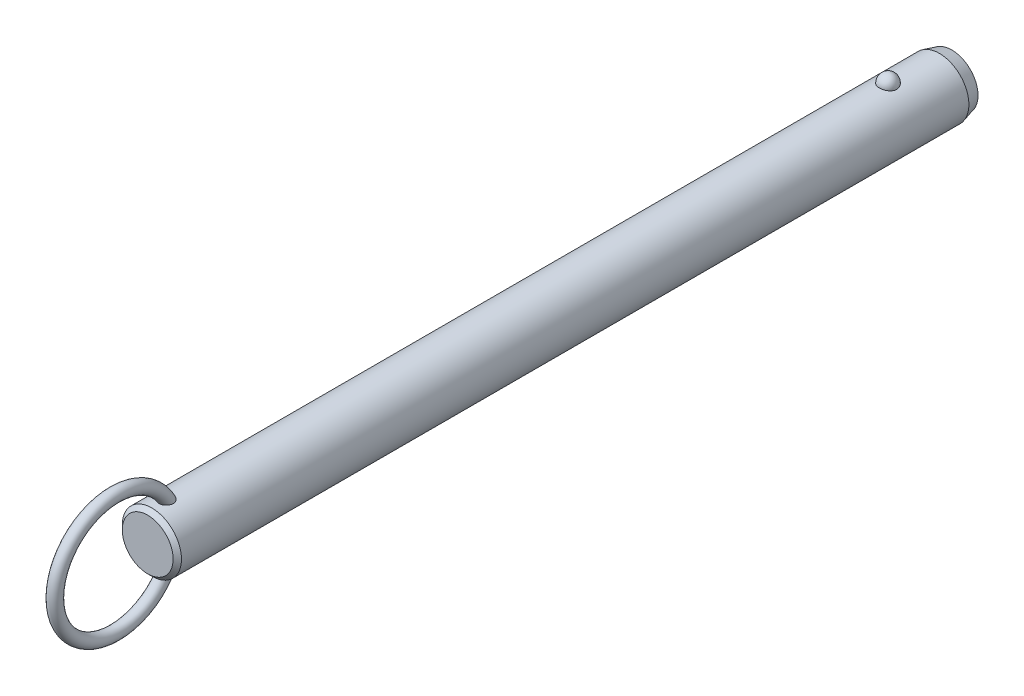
ISO-10303-21;
HEADER;
FILE_DESCRIPTION(('STEP AP214'),'2;1');
FILE_NAME('part.step','',(''),(''),'','','');
FILE_SCHEMA(('AUTOMOTIVE_DESIGN { 1 0 10303 214 1 1 1 1 }'));
ENDSEC;
DATA;
#1=APPLICATION_CONTEXT('core data for automotive mechanical design processes');
#2=APPLICATION_PROTOCOL_DEFINITION('international standard','automotive_design',2000,#1);
#3=PRODUCT_CONTEXT('',#1,'mechanical');
#4=PRODUCT('Part','Part','',(#3));
#5=PRODUCT_RELATED_PRODUCT_CATEGORY('part','',(#4));
#6=PRODUCT_DEFINITION_FORMATION('','',#4);
#7=PRODUCT_DEFINITION_CONTEXT('part definition',#1,'design');
#8=PRODUCT_DEFINITION('design','',#6,#7);
#9=PRODUCT_DEFINITION_SHAPE('','',#8);
#10=(LENGTH_UNIT() NAMED_UNIT(*) SI_UNIT(.MILLI.,.METRE.));
#11=(NAMED_UNIT(*) PLANE_ANGLE_UNIT() SI_UNIT($,.RADIAN.));
#12=(NAMED_UNIT(*) SI_UNIT($,.STERADIAN.) SOLID_ANGLE_UNIT());
#13=UNCERTAINTY_MEASURE_WITH_UNIT(LENGTH_MEASURE(1.E-05),#10,'distance_accuracy_value','');
#14=(GEOMETRIC_REPRESENTATION_CONTEXT(3) GLOBAL_UNCERTAINTY_ASSIGNED_CONTEXT((#13)) GLOBAL_UNIT_ASSIGNED_CONTEXT((#10,
#11,#12)) REPRESENTATION_CONTEXT('',''));
#15=CARTESIAN_POINT('',(0.,0.,0.));
#16=DIRECTION('',(0.,0.,1.));
#17=DIRECTION('',(1.,0.,0.));
#18=AXIS2_PLACEMENT_3D('',#15,#16,#17);
#19=CARTESIAN_POINT('',(0.,0.,167.6));
#20=DIRECTION('',(0.,0.,-1.));
#21=DIRECTION('',(-1.,0.,0.));
#22=AXIS2_PLACEMENT_3D('',#19,#20,#21);
#23=CYLINDRICAL_SURFACE('',#22,7.1);
#24=CARTESIAN_POINT('',(2.0769088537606,6.78943661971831,-2.1));
#25=CARTESIAN_POINT('',(2.07690739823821,6.78943796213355,-1.98268154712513));
#26=CARTESIAN_POINT('',(2.06738130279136,6.79237331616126,-1.86534506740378));
#27=CARTESIAN_POINT('',(2.0295040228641,6.8037853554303,-1.63400788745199));
#28=CARTESIAN_POINT('',(2.00114757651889,6.81226358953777,-1.52000812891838));
#29=CARTESIAN_POINT('',(1.92632025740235,6.83379798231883,-1.29863433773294));
#30=CARTESIAN_POINT('',(1.87985726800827,6.84685214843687,-1.19125744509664));
#31=CARTESIAN_POINT('',(1.76995205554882,6.87608091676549,-0.98604657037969));
#32=CARTESIAN_POINT('',(1.70650980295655,6.8922555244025,-0.88821260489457));
#33=CARTESIAN_POINT('',(1.5638119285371,6.92602930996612,-0.704242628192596));
#34=CARTESIAN_POINT('',(1.4844714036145,6.94363582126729,-0.618173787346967));
#35=CARTESIAN_POINT('',(1.31221746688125,6.97823658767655,-0.460740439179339));
#36=CARTESIAN_POINT('',(1.21930409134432,6.99523084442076,-0.389375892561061));
#37=CARTESIAN_POINT('',(1.02268781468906,7.02666176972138,-0.263547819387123));
#38=CARTESIAN_POINT('',(0.91902009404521,7.04110638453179,-0.209031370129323));
#39=CARTESIAN_POINT('',(0.703548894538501,7.06588726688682,-0.118163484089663));
#40=CARTESIAN_POINT('',(0.591746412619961,7.07622403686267,-0.0818098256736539));
#41=CARTESIAN_POINT('',(0.365557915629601,7.09147068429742,-0.0288711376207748));
#42=CARTESIAN_POINT('',(0.251267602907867,7.09648447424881,-0.0119070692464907));
#43=CARTESIAN_POINT('',(0.0213499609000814,7.10089837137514,0.00304925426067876));
#44=CARTESIAN_POINT('',(-0.0942772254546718,7.10029907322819,0.00104351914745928));
#45=CARTESIAN_POINT('',(-0.321651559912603,7.09360829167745,-0.0216931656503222));
#46=CARTESIAN_POINT('',(-0.433431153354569,7.08760388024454,-0.0421272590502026));
#47=CARTESIAN_POINT('',(-0.651862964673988,7.07086131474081,-0.100729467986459));
#48=CARTESIAN_POINT('',(-0.758515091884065,7.06012307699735,-0.138897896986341));
#49=CARTESIAN_POINT('',(-0.964449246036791,7.03496097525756,-0.232213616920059));
#50=CARTESIAN_POINT('',(-1.06368095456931,7.02051445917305,-0.287465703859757));
#51=CARTESIAN_POINT('',(-1.25145353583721,6.98948740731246,-0.413383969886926));
#52=CARTESIAN_POINT('',(-1.33999321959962,6.97290663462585,-0.48405186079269));
#53=CARTESIAN_POINT('',(-1.50591604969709,6.93898770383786,-0.640594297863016));
#54=CARTESIAN_POINT('',(-1.58302488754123,6.92164094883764,-0.726757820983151));
#55=CARTESIAN_POINT('',(-1.72189320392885,6.8884103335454,-0.91092752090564));
#56=CARTESIAN_POINT('',(-1.78365144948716,6.87252659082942,-1.008934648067));
#57=CARTESIAN_POINT('',(-1.89101272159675,6.84377189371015,-1.21549497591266));
#58=CARTESIAN_POINT('',(-1.93639553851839,6.83094274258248,-1.32416860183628));
#59=CARTESIAN_POINT('',(-2.00874275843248,6.81002070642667,-1.54791500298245));
#60=CARTESIAN_POINT('',(-2.03570774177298,6.80192767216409,-1.66298757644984));
#61=CARTESIAN_POINT('',(-2.07047276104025,6.7914266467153,-1.89571453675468));
#62=CARTESIAN_POINT('',(-2.07835878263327,6.78899315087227,-2.01335491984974));
#63=CARTESIAN_POINT('',(-2.07502083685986,6.79001409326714,-2.24833570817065));
#64=CARTESIAN_POINT('',(-2.06379746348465,6.7934683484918,-2.36567612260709));
#65=CARTESIAN_POINT('',(-2.02263913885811,6.80583442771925,-2.59603194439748));
#66=CARTESIAN_POINT('',(-1.99281127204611,6.81471501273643,-2.70906820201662));
#67=CARTESIAN_POINT('',(-1.91526639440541,6.83691232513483,-2.92836575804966));
#68=CARTESIAN_POINT('',(-1.8675486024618,6.85022924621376,-3.03462676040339));
#69=CARTESIAN_POINT('',(-1.75504492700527,6.87991336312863,-3.23806487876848));
#70=CARTESIAN_POINT('',(-1.69015924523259,6.89629822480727,-3.33518422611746));
#71=CARTESIAN_POINT('',(-1.54505404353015,6.93024852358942,-3.51697105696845));
#72=CARTESIAN_POINT('',(-1.46483385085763,6.94781401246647,-3.60163799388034));
#73=CARTESIAN_POINT('',(-1.29071406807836,6.98225977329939,-3.75654119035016));
#74=CARTESIAN_POINT('',(-1.19675650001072,6.99913673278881,-3.82671308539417));
#75=CARTESIAN_POINT('',(-0.997940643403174,7.03023618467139,-3.9501837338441));
#76=CARTESIAN_POINT('',(-0.89308318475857,7.04445887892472,-4.00348377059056));
#77=CARTESIAN_POINT('',(-0.676902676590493,7.06848365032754,-4.09107242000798));
#78=CARTESIAN_POINT('',(-0.565686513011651,7.0783430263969,-4.12560889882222));
#79=CARTESIAN_POINT('',(-0.338739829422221,7.09282534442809,-4.17575450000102));
#80=CARTESIAN_POINT('',(-0.223009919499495,7.09744899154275,-4.19136617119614));
#81=CARTESIAN_POINT('',(0.00707628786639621,7.10090930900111,-4.20307965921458));
#82=CARTESIAN_POINT('',(0.121410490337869,7.09986531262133,-4.19958377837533));
#83=CARTESIAN_POINT('',(0.347815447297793,7.092380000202,-4.17411564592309));
#84=CARTESIAN_POINT('',(0.459886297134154,7.08593891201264,-4.15214417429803));
#85=CARTESIAN_POINT('',(0.678084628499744,7.06838983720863,-4.09049562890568));
#86=CARTESIAN_POINT('',(0.784237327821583,7.05730369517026,-4.05090137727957));
#87=CARTESIAN_POINT('',(0.988305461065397,7.03163139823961,-3.95511447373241));
#88=CARTESIAN_POINT('',(1.08622031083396,7.01704499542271,-3.89892064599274));
#89=CARTESIAN_POINT('',(1.27284490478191,6.98562668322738,-3.77035541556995));
#90=CARTESIAN_POINT('',(1.36137372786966,6.96876135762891,-3.69772964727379));
#91=CARTESIAN_POINT('',(1.52509486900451,6.93477412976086,-3.53878279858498));
#92=CARTESIAN_POINT('',(1.60028496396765,6.91765218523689,-3.45245943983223));
#93=CARTESIAN_POINT('',(1.73681688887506,6.88465753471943,-3.26658774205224));
#94=CARTESIAN_POINT('',(1.79785966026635,6.86881574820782,-3.16681408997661));
#95=CARTESIAN_POINT('',(1.90265327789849,6.84053157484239,-2.95814408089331));
#96=CARTESIAN_POINT('',(1.94640861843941,6.82808830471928,-2.84925010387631));
#97=CARTESIAN_POINT('',(2.01274378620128,6.80881460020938,-2.63454318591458));
#98=CARTESIAN_POINT('',(2.03676193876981,6.80160856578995,-2.52920574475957));
#99=CARTESIAN_POINT('',(2.06884490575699,6.79191902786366,-2.3159172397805));
#100=CARTESIAN_POINT('',(2.07691019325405,6.78943538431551,-2.20796625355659));
#101=CARTESIAN_POINT('',(2.0769088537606,6.78943661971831,-2.1));
#102=B_SPLINE_CURVE_WITH_KNOTS('',3,(#24,#25,#26,#27,#28,#29,#30,#31,#32,#33,#34,#35,#36,#37,
#38,#39,#40,#41,#42,#43,#44,#45,#46,#47,#48,#49,#50,#51,#52,#53,#54,#55,#56,#57,#58,#59,#60,#61,
#62,#63,#64,#65,#66,#67,#68,#69,#70,#71,#72,#73,#74,#75,#76,#77,#78,#79,#80,#81,#82,#83,#84,#85,
#86,#87,#88,#89,#90,#91,#92,#93,#94,#95,#96,#97,#98,#99,#100,#101),.UNSPECIFIED.,.T.,.F.,(4,2,2,
2,2,2,2,2,2,2,2,2,2,2,2,2,2,2,2,2,2,2,2,2,2,2,2,2,2,2,2,2,2,2,2,2,2,2,4),(0.,0.351568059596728,
0.703234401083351,1.05474780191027,1.40626181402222,1.75970563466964,2.11314851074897,
2.4654696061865,2.81774759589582,3.16301449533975,3.50824481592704,3.84801136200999,
4.18778391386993,4.52968352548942,4.87162112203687,5.22076181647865,5.56993054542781,
5.92363364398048,6.27732559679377,6.62942052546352,6.98150450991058,7.33158042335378,
7.68167162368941,8.03384443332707,8.38603269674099,8.73975272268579,9.09344583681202,
9.44234545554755,9.79119807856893,10.1327344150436,10.4742563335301,10.8141898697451,
11.1541474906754,11.4997793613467,11.8454687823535,12.1979079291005,12.5502553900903,
12.8738073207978,13.1973496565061),.UNSPECIFIED.);
#103=CARTESIAN_POINT('',(2.0769088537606,6.78943661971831,-2.1));
#104=VERTEX_POINT('',#103);
#105=EDGE_CURVE('E41',#104,#104,#102,.T.);
#106=ORIENTED_EDGE('',*,*,#105,.T.);
#107=EDGE_LOOP('',(#106));
#108=FACE_BOUND('',#107,.T.);
#109=CARTESIAN_POINT('',(0.,0.,174.52));
#110=DIRECTION('',(0.,0.,1.));
#111=DIRECTION('',(1.,0.,0.));
#112=AXIS2_PLACEMENT_3D('',#109,#110,#111);
#113=CIRCLE('',#112,7.1);
#114=CARTESIAN_POINT('',(7.1,0.,174.52));
#115=VERTEX_POINT('',#114);
#116=EDGE_CURVE('E10',#115,#115,#113,.F.);
#117=ORIENTED_EDGE('',*,*,#116,.T.);
#118=EDGE_LOOP('',(#117));
#119=FACE_BOUND('',#118,.T.);
#120=CARTESIAN_POINT('',(-0.429539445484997,-7.08699541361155,169.342921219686));
#121=CARTESIAN_POINT('',(-0.508331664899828,-7.08221999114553,169.366876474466));
#122=CARTESIAN_POINT('',(-0.585039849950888,-7.07624016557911,169.397457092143));
#123=CARTESIAN_POINT('',(-0.73208265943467,-7.06254296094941,169.471024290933));
#124=CARTESIAN_POINT('',(-0.802417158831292,-7.05482554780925,169.514011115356));
#125=CARTESIAN_POINT('',(-0.934722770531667,-7.03851844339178,169.611113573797));
#126=CARTESIAN_POINT('',(-0.996700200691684,-7.02992941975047,169.665220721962));
#127=CARTESIAN_POINT('',(-1.11079942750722,-7.01280697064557,169.782967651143));
#128=CARTESIAN_POINT('',(-1.16292136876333,-7.00427354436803,169.846607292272));
#129=CARTESIAN_POINT('',(-1.25705660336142,-6.98799959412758,169.982687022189));
#130=CARTESIAN_POINT('',(-1.29888032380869,-6.98027525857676,170.055259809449));
#131=CARTESIAN_POINT('',(-1.37069920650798,-6.96652886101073,170.206168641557));
#132=CARTESIAN_POINT('',(-1.40069157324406,-6.96050720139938,170.284506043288));
#133=CARTESIAN_POINT('',(-1.45043507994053,-6.95031881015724,170.450190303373));
#134=CARTESIAN_POINT('',(-1.46937115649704,-6.94630231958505,170.537789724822));
#135=CARTESIAN_POINT('',(-1.49424917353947,-6.94099239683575,170.714871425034));
#136=CARTESIAN_POINT('',(-1.50018601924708,-6.93970003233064,170.804354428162));
#137=CARTESIAN_POINT('',(-1.49978214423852,-6.93978815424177,170.994060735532));
#138=CARTESIAN_POINT('',(-1.49187639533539,-6.94150934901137,171.094279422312));
#139=CARTESIAN_POINT('',(-1.46177925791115,-6.94790814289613,171.292479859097));
#140=CARTESIAN_POINT('',(-1.43957541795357,-6.95258831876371,171.390459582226));
#141=CARTESIAN_POINT('',(-1.37783293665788,-6.96510647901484,171.59536292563));
#142=CARTESIAN_POINT('',(-1.33634073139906,-6.97328848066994,171.701680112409));
#143=CARTESIAN_POINT('',(-1.23686994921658,-6.99161706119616,171.906177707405));
#144=CARTESIAN_POINT('',(-1.17889192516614,-7.00176357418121,172.004358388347));
#145=CARTESIAN_POINT('',(-1.0587512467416,-7.02082898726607,172.172374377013));
#146=CARTESIAN_POINT('',(-0.999247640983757,-7.02963746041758,172.244123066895));
#147=CARTESIAN_POINT('',(-0.869494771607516,-7.04686074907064,172.377195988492));
#148=CARTESIAN_POINT('',(-0.799263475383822,-7.05527619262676,172.438537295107));
#149=CARTESIAN_POINT('',(-0.665408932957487,-7.06899457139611,172.535131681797));
#150=CARTESIAN_POINT('',(-0.603817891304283,-7.07457275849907,172.573151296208));
#151=CARTESIAN_POINT('',(-0.475172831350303,-7.08437420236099,172.638758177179));
#152=CARTESIAN_POINT('',(-0.408123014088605,-7.08859848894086,172.666353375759));
#153=CARTESIAN_POINT('',(-0.269431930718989,-7.09522749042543,172.709256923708));
#154=CARTESIAN_POINT('',(-0.197757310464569,-7.09761688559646,172.724461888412));
#155=CARTESIAN_POINT('',(-0.0527849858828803,-7.10017268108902,172.740716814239));
#156=CARTESIAN_POINT('',(0.0205115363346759,-7.10034065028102,172.741776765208));
#157=CARTESIAN_POINT('',(0.156426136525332,-7.09855986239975,172.730461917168));
#158=CARTESIAN_POINT('',(0.219199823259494,-7.09688191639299,172.719806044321));
#159=CARTESIAN_POINT('',(0.342134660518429,-7.09201880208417,172.688537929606));
#160=CARTESIAN_POINT('',(0.402295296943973,-7.08883333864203,172.667923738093));
#161=CARTESIAN_POINT('',(0.520687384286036,-7.08113868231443,172.617212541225));
#162=CARTESIAN_POINT('',(0.578791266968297,-7.07658958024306,172.586827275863));
#163=CARTESIAN_POINT('',(0.690173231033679,-7.06659708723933,172.518367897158));
#164=CARTESIAN_POINT('',(0.743447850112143,-7.061153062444,172.480288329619));
#165=CARTESIAN_POINT('',(0.870947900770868,-7.04680292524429,172.376592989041));
#166=CARTESIAN_POINT('',(0.941828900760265,-7.03755800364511,172.306897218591));
#167=CARTESIAN_POINT('',(1.07136606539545,-7.01900793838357,172.156945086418));
#168=CARTESIAN_POINT('',(1.13000013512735,-7.00970271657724,172.076670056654));
#169=CARTESIAN_POINT('',(1.23579584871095,-6.99183327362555,171.906899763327));
#170=CARTESIAN_POINT('',(1.28274271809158,-6.98328455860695,171.817269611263));
#171=CARTESIAN_POINT('',(1.36351442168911,-6.96796352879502,171.632176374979));
#172=CARTESIAN_POINT('',(1.39733971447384,-6.96119115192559,171.536713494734));
#173=CARTESIAN_POINT('',(1.45579181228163,-6.94922464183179,171.32530928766));
#174=CARTESIAN_POINT('',(1.47790145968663,-6.94449000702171,171.208631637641));
#175=CARTESIAN_POINT('',(1.50168752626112,-6.93938731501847,170.973015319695));
#176=CARTESIAN_POINT('',(1.50336085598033,-6.93901991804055,170.85407631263));
#177=CARTESIAN_POINT('',(1.48486516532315,-6.9430010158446,170.62360799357));
#178=CARTESIAN_POINT('',(1.46573441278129,-6.9471253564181,170.511995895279));
#179=CARTESIAN_POINT('',(1.40606892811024,-6.95944667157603,170.294886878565));
#180=CARTESIAN_POINT('',(1.36556446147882,-6.96763788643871,170.1893815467));
#181=CARTESIAN_POINT('',(1.2708270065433,-6.98548038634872,170.004287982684));
#182=CARTESIAN_POINT('',(1.21949810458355,-6.99473841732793,169.923171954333));
#183=CARTESIAN_POINT('',(1.10242050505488,-7.01414069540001,169.772227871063));
#184=CARTESIAN_POINT('',(1.03668119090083,-7.02428436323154,169.70239252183));
#185=CARTESIAN_POINT('',(0.900559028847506,-7.04295285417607,169.583573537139));
#186=CARTESIAN_POINT('',(0.831428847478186,-7.05153466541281,169.533157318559));
#187=CARTESIAN_POINT('',(0.685291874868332,-7.06723150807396,169.445142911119));
#188=CARTESIAN_POINT('',(0.608287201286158,-7.07434693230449,169.407541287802));
#189=CARTESIAN_POINT('',(0.451878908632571,-7.08602232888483,169.347491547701));
#190=CARTESIAN_POINT('',(0.372686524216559,-7.09067127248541,169.324508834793));
#191=CARTESIAN_POINT('',(0.21147739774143,-7.09730788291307,169.292035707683));
#192=CARTESIAN_POINT('',(0.129460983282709,-7.09929585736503,169.28254373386));
#193=CARTESIAN_POINT('',(-0.0332905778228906,-7.10037858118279,169.277351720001));
#194=CARTESIAN_POINT('',(-0.114016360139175,-7.09953334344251,169.281365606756));
#195=CARTESIAN_POINT('',(-0.273670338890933,-7.09517338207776,169.302454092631));
#196=CARTESIAN_POINT('',(-0.352598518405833,-7.09165863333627,169.319528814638));
#197=CARTESIAN_POINT('',(-0.429539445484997,-7.08699541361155,169.342921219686));
#198=B_SPLINE_CURVE_WITH_KNOTS('',3,(#120,#121,#122,#123,#124,#125,#126,#127,#128,#129,#130,
#131,#132,#133,#134,#135,#136,#137,#138,#139,#140,#141,#142,#143,#144,#145,#146,#147,#148,#149,
#150,#151,#152,#153,#154,#155,#156,#157,#158,#159,#160,#161,#162,#163,#164,#165,#166,#167,#168,
#169,#170,#171,#172,#173,#174,#175,#176,#177,#178,#179,#180,#181,#182,#183,#184,#185,#186,#187,
#188,#189,#190,#191,#192,#193,#194,#195,#196,#197),.UNSPECIFIED.,.T.,.F.,(4,2,2,2,2,2,2,2,2,2,2,
2,2,2,2,2,2,2,2,2,2,2,2,2,2,2,2,2,2,2,2,2,2,2,2,2,2,2,4),(0.,0.247183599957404,
0.494372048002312,0.741372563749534,0.988369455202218,1.23962059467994,1.490931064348,
1.75897818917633,2.02713035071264,2.3275826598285,2.62829697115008,2.97008736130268,
3.31186629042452,3.59175319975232,3.87117637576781,4.08813841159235,4.30493502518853,
4.5235225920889,4.74195577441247,4.93215328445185,5.12238804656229,5.31884850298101,
5.51544871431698,5.81332317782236,6.11173048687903,6.41527266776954,6.71880423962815,
7.07358156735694,7.42841252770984,7.76631485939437,8.10373999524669,8.39142246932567,
8.67891817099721,8.93560332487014,9.19221962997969,9.43881106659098,9.68537399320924,
9.9267475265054,10.1681233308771),.UNSPECIFIED.);
#199=CARTESIAN_POINT('',(-0.429539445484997,-7.08699541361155,169.342921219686));
#200=VERTEX_POINT('',#199);
#201=EDGE_CURVE('E59',#200,#200,#198,.T.);
#202=ORIENTED_EDGE('',*,*,#201,.T.);
#203=EDGE_LOOP('',(#202));
#204=FACE_BOUND('',#203,.T.);
#205=CARTESIAN_POINT('',(-0.429539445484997,7.08699541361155,169.342921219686));
#206=CARTESIAN_POINT('',(-0.351665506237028,7.09171429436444,169.319246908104));
#207=CARTESIAN_POINT('',(-0.271733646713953,7.09525896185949,169.302036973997));
#208=CARTESIAN_POINT('',(-0.110026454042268,7.09960839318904,169.281005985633));
#209=CARTESIAN_POINT('',(-0.0282502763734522,7.10041187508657,169.277191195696));
#210=CARTESIAN_POINT('',(0.134782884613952,7.09918849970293,169.283059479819));
#211=CARTESIAN_POINT('',(0.216039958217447,7.09716214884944,169.29274013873));
#212=CARTESIAN_POINT('',(0.375730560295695,7.09050177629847,169.325347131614));
#213=CARTESIAN_POINT('',(0.454164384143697,7.08586802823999,169.348272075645));
#214=CARTESIAN_POINT('',(0.606025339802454,7.07449911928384,169.406771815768));
#215=CARTESIAN_POINT('',(0.67945100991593,7.06776334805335,169.442350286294));
#216=CARTESIAN_POINT('',(0.819234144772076,7.05292866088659,169.525175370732));
#217=CARTESIAN_POINT('',(0.88559181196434,7.04482978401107,169.572421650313));
#218=CARTESIAN_POINT('',(1.00993211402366,7.02808709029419,169.677590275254));
#219=CARTESIAN_POINT('',(1.06785399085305,7.01943990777,169.735583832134));
#220=CARTESIAN_POINT('',(1.17342527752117,7.00256662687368,169.860301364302));
#221=CARTESIAN_POINT('',(1.22107408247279,6.99434055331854,169.927025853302));
#222=CARTESIAN_POINT('',(1.30652927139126,6.97889183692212,170.069362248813));
#223=CARTESIAN_POINT('',(1.34399711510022,6.97170674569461,170.145180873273));
#224=CARTESIAN_POINT('',(1.40682616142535,6.95930080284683,170.301810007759));
#225=CARTESIAN_POINT('',(1.43218374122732,6.95408053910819,170.38262200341));
#226=CARTESIAN_POINT('',(1.47246409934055,6.94566853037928,170.553531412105));
#227=CARTESIAN_POINT('',(1.48642590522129,6.9426653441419,170.64386307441));
#228=CARTESIAN_POINT('',(1.5011410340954,6.93949744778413,170.825619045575));
#229=CARTESIAN_POINT('',(1.50188917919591,6.93933385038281,170.917043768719));
#230=CARTESIAN_POINT('',(1.49030464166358,6.94183245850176,171.11084381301));
#231=CARTESIAN_POINT('',(1.47627413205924,6.94486147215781,171.213112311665));
#232=CARTESIAN_POINT('',(1.43356351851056,6.95380194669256,171.414471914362));
#233=CARTESIAN_POINT('',(1.4048676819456,6.95971650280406,171.513559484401));
#234=CARTESIAN_POINT('',(1.32908750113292,6.97461208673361,171.718908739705));
#235=CARTESIAN_POINT('',(1.28011435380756,6.98388945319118,171.824456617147));
#236=CARTESIAN_POINT('',(1.16520357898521,7.00397743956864,172.025760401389));
#237=CARTESIAN_POINT('',(1.09927694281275,7.01478706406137,172.121522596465));
#238=CARTESIAN_POINT('',(0.969361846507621,7.03373936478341,172.276756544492));
#239=CARTESIAN_POINT('',(0.909042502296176,7.04187023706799,172.339303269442));
#240=CARTESIAN_POINT('',(0.779178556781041,7.05741732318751,172.454053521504));
#241=CARTESIAN_POINT('',(0.709649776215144,7.06483472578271,172.506274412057));
#242=CARTESIAN_POINT('',(0.576854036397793,7.0767751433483,172.588113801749));
#243=CARTESIAN_POINT('',(0.515118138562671,7.08158033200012,172.620164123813));
#244=CARTESIAN_POINT('',(0.387127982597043,7.08972701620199,172.673765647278));
#245=CARTESIAN_POINT('',(0.320877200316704,7.09306962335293,172.695324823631));
#246=CARTESIAN_POINT('',(0.185041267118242,7.09791507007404,172.726400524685));
#247=CARTESIAN_POINT('',(0.115437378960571,7.09940591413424,172.735838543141));
#248=CARTESIAN_POINT('',(-0.0243157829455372,7.10030171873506,172.741522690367));
#249=CARTESIAN_POINT('',(-0.0944648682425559,7.0997073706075,172.737773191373));
#250=CARTESIAN_POINT('',(-0.225713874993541,7.09668414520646,172.718508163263));
#251=CARTESIAN_POINT('',(-0.287006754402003,7.09444865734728,172.704232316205));
#252=CARTESIAN_POINT('',(-0.406555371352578,7.08860360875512,172.666368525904));
#253=CARTESIAN_POINT('',(-0.464809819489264,7.08499346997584,172.642776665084));
#254=CARTESIAN_POINT('',(-0.594955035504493,7.07541654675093,172.578923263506));
#255=CARTESIAN_POINT('',(-0.665389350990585,7.06906574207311,172.535753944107));
#256=CARTESIAN_POINT('',(-0.798242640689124,7.05530261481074,172.438587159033));
#257=CARTESIAN_POINT('',(-0.860645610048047,7.0478882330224,172.384568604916));
#258=CARTESIAN_POINT('',(-0.994249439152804,7.03045217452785,172.250996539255));
#259=CARTESIAN_POINT('',(-1.06260129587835,7.02030745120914,172.168614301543));
#260=CARTESIAN_POINT('',(-1.18502045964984,7.00068382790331,171.993843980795));
#261=CARTESIAN_POINT('',(-1.23907684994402,6.99120544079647,171.901448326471));
#262=CARTESIAN_POINT('',(-1.33335589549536,6.97384343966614,171.708008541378));
#263=CARTESIAN_POINT('',(-1.37336138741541,6.96598557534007,171.606856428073));
#264=CARTESIAN_POINT('',(-1.43770677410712,6.9529905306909,171.399504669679));
#265=CARTESIAN_POINT('',(-1.46204473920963,6.94785368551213,171.29330440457));
#266=CARTESIAN_POINT('',(-1.49537533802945,6.94076296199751,171.068231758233));
#267=CARTESIAN_POINT('',(-1.50273564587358,6.93914842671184,170.94909751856));
#268=CARTESIAN_POINT('',(-1.4954555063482,6.94072368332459,170.711470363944));
#269=CARTESIAN_POINT('',(-1.48082914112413,6.94391040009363,170.592977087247));
#270=CARTESIAN_POINT('',(-1.43076401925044,6.95438579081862,170.373432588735));
#271=CARTESIAN_POINT('',(-1.3976222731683,6.96121852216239,170.271841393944));
#272=CARTESIAN_POINT('',(-1.31211274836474,6.97783941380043,170.077351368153));
#273=CARTESIAN_POINT('',(-1.25976607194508,6.98762432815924,169.98444313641));
#274=CARTESIAN_POINT('',(-1.14583073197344,7.00713153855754,169.824160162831));
#275=CARTESIAN_POINT('',(-1.08665947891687,7.01665982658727,169.755035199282));
#276=CARTESIAN_POINT('',(-0.95660664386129,7.03556646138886,169.628878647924));
#277=CARTESIAN_POINT('',(-0.88573712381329,7.04494495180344,169.571834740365));
#278=CARTESIAN_POINT('',(-0.751558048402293,7.06035735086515,169.483100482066));
#279=CARTESIAN_POINT('',(-0.690120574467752,7.0666695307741,169.448593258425));
#280=CARTESIAN_POINT('',(-0.562815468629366,7.07794609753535,169.388750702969));
#281=CARTESIAN_POINT('',(-0.496948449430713,7.08291067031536,169.363414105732));
#282=CARTESIAN_POINT('',(-0.429539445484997,7.08699541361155,169.342921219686));
#283=B_SPLINE_CURVE_WITH_KNOTS('',3,(#205,#206,#207,#208,#209,#210,#211,#212,#213,#214,#215,
#216,#217,#218,#219,#220,#221,#222,#223,#224,#225,#226,#227,#228,#229,#230,#231,#232,#233,#234,
#235,#236,#237,#238,#239,#240,#241,#242,#243,#244,#245,#246,#247,#248,#249,#250,#251,#252,#253,
#254,#255,#256,#257,#258,#259,#260,#261,#262,#263,#264,#265,#266,#267,#268,#269,#270,#271,#272,
#273,#274,#275,#276,#277,#278,#279,#280,#281,#282),.UNSPECIFIED.,.T.,.F.,(4,2,2,2,2,2,2,2,2,2,2,
2,2,2,2,2,2,2,2,2,2,2,2,2,2,2,2,2,2,2,2,2,2,2,2,2,2,2,4),(0.,0.244335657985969,
0.488785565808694,0.733191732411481,0.977572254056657,1.2220237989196,1.46646834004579,
1.71259457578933,1.9587352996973,2.21226768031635,2.46587585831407,2.73913816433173,
3.01250754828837,3.32109936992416,3.63002293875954,3.9786351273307,4.32702187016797,
4.58793945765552,4.84841449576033,5.05676704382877,5.26496096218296,5.47449661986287,
5.68396281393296,5.87205447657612,6.06022532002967,6.30743751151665,6.55513496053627,
6.87602468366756,7.1971587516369,7.52305774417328,7.84899686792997,8.2051615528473,
8.56109821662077,8.88040084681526,9.19935367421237,9.47236282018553,9.74509220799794,
9.95662250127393,10.1681235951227),.UNSPECIFIED.);
#284=CARTESIAN_POINT('',(-0.429539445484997,7.08699541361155,169.342921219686));
#285=VERTEX_POINT('',#284);
#286=EDGE_CURVE('E67',#285,#285,#283,.T.);
#287=ORIENTED_EDGE('',*,*,#286,.T.);
#288=EDGE_LOOP('',(#287));
#289=FACE_BOUND('',#288,.T.);
#290=CARTESIAN_POINT('',(0.,0.,-14.4));
#291=DIRECTION('',(0.,0.,-1.));
#292=DIRECTION('',(-1.,0.,0.));
#293=AXIS2_PLACEMENT_3D('',#290,#291,#292);
#294=CIRCLE('',#293,7.1);
#295=CARTESIAN_POINT('',(-7.1,0.,-14.4));
#296=VERTEX_POINT('',#295);
#297=EDGE_CURVE('E56',#296,#296,#294,.F.);
#298=ORIENTED_EDGE('',*,*,#297,.T.);
#299=EDGE_LOOP('',(#298));
#300=FACE_BOUND('',#299,.T.);
#301=ADVANCED_FACE('F37',(#108,#119,#204,#289,#300),#23,.T.);
#302=CARTESIAN_POINT('',(0.,0.,-17.4));
#303=DIRECTION('',(0.,0.,-1.));
#304=DIRECTION('',(-1.,0.,0.));
#305=AXIS2_PLACEMENT_3D('',#302,#303,#304);
#306=PLANE('',#305);
#307=CARTESIAN_POINT('',(0.,0.,-17.4));
#308=DIRECTION('',(0.,0.,-1.));
#309=DIRECTION('',(-1.,0.,0.));
#310=AXIS2_PLACEMENT_3D('',#307,#308,#309);
#311=CIRCLE('',#310,6.29615242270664);
#312=CARTESIAN_POINT('',(-6.29615242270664,0.,-17.4));
#313=VERTEX_POINT('',#312);
#314=EDGE_CURVE('E66',#313,#313,#311,.T.);
#315=ORIENTED_EDGE('',*,*,#314,.T.);
#316=EDGE_LOOP('',(#315));
#317=FACE_BOUND('',#316,.T.);
#318=ADVANCED_FACE('F85',(#317),#306,.T.);
#319=CARTESIAN_POINT('',(0.,0.,-17.4));
#320=DIRECTION('',(0.,0.,1.));
#321=DIRECTION('',(1.,0.,0.));
#322=AXIS2_PLACEMENT_3D('',#319,#320,#321);
#323=CONICAL_SURFACE('',#322,6.29615242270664,0.261799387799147);
#324=ORIENTED_EDGE('',*,*,#297,.F.);
#325=EDGE_LOOP('',(#324));
#326=FACE_BOUND('',#325,.T.);
#327=ORIENTED_EDGE('',*,*,#314,.F.);
#328=EDGE_LOOP('',(#327));
#329=FACE_BOUND('',#328,.T.);
#330=ADVANCED_FACE('F83',(#326,#329),#323,.T.);
#331=CARTESIAN_POINT('',(0.,0.,175.52));
#332=DIRECTION('',(0.,0.,1.));
#333=DIRECTION('',(1.,0.,0.));
#334=AXIS2_PLACEMENT_3D('',#331,#332,#333);
#335=PLANE('',#334);
#336=CARTESIAN_POINT('',(0.,0.,175.52));
#337=DIRECTION('',(0.,0.,1.));
#338=DIRECTION('',(1.,0.,0.));
#339=AXIS2_PLACEMENT_3D('',#336,#337,#338);
#340=CIRCLE('',#339,6.09999999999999);
#341=CARTESIAN_POINT('',(6.09999999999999,0.,175.52));
#342=VERTEX_POINT('',#341);
#343=EDGE_CURVE('E50',#342,#342,#340,.T.);
#344=ORIENTED_EDGE('',*,*,#343,.T.);
#345=EDGE_LOOP('',(#344));
#346=FACE_BOUND('',#345,.T.);
#347=ADVANCED_FACE('F77',(#346),#335,.T.);
#348=CARTESIAN_POINT('',(0.,0.,183.45));
#349=DIRECTION('',(1.,0.,0.));
#350=DIRECTION('',(0.,0.,-1.));
#351=AXIS2_PLACEMENT_3D('',#348,#349,#350);
#352=TOROIDAL_SURFACE('',#351,14.35,1.5);
#353=ORIENTED_EDGE('',*,*,#286,.F.);
#354=EDGE_LOOP('',(#353));
#355=FACE_BOUND('',#354,.T.);
#356=ORIENTED_EDGE('',*,*,#201,.F.);
#357=EDGE_LOOP('',(#356));
#358=FACE_BOUND('',#357,.T.);
#359=ADVANCED_FACE('F73',(#355,#358),#352,.T.);
#360=CARTESIAN_POINT('',(0.,0.,175.52));
#361=DIRECTION('',(0.,0.,-1.));
#362=DIRECTION('',(-1.,0.,0.));
#363=AXIS2_PLACEMENT_3D('',#360,#361,#362);
#364=CONICAL_SURFACE('',#363,6.09999999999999,0.78539816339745);
#365=ORIENTED_EDGE('',*,*,#116,.F.);
#366=EDGE_LOOP('',(#365));
#367=FACE_BOUND('',#366,.T.);
#368=ORIENTED_EDGE('',*,*,#343,.F.);
#369=EDGE_LOOP('',(#368));
#370=FACE_BOUND('',#369,.T.);
#371=ADVANCED_FACE('F39',(#367,#370),#364,.T.);
#372=CARTESIAN_POINT('',(0.,7.1,-2.1));
#373=DIRECTION('',(0.,1.,0.));
#374=DIRECTION('',(0.,0.,1.));
#375=AXIS2_PLACEMENT_3D('',#372,#373,#374);
#376=SPHERICAL_SURFACE('',#375,2.10000000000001);
#377=ORIENTED_EDGE('',*,*,#105,.F.);
#378=EDGE_LOOP('',(#377));
#379=FACE_BOUND('',#378,.T.);
#380=ADVANCED_FACE('F79',(#379),#376,.T.);
#381=CLOSED_SHELL('',(#301,#318,#330,#347,#359,#371,#380));
#382=MANIFOLD_SOLID_BREP('B2',#381);
#383=ADVANCED_BREP_SHAPE_REPRESENTATION('',(#18,#382),#14);
#384=SHAPE_DEFINITION_REPRESENTATION(#9,#383);
ENDSEC;
END-ISO-10303-21;
